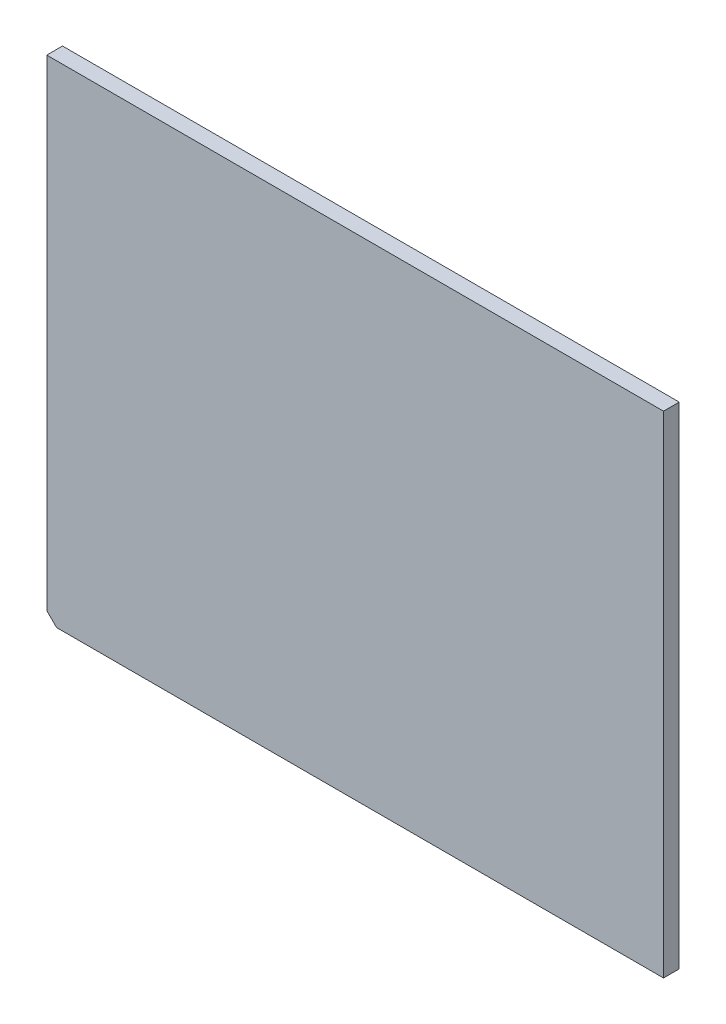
from build123d import *

# Parameters (mm, degrees)
SKETCH1_W           = 196
SKETCH1_H           = 156
BOSS_EXTRUDE1_DEPTH = 5
CHAMFER1_SIZE       = 3.12


with BuildPart() as part:
    # Sketch1 → Boss-Extrude1 (new body)
    with BuildSketch(Plane.XY):
        Rectangle(SKETCH1_W, SKETCH1_H)
    extrude(amount=-BOSS_EXTRUDE1_DEPTH)

    # Chamfer1
    chamfer1_edges = [part.edges().sort_by_distance(p)[0] for p in [
        (-98, -78, -2.5),
    ]]
    chamfer(chamfer1_edges, length=CHAMFER1_SIZE)


solid = part.part
